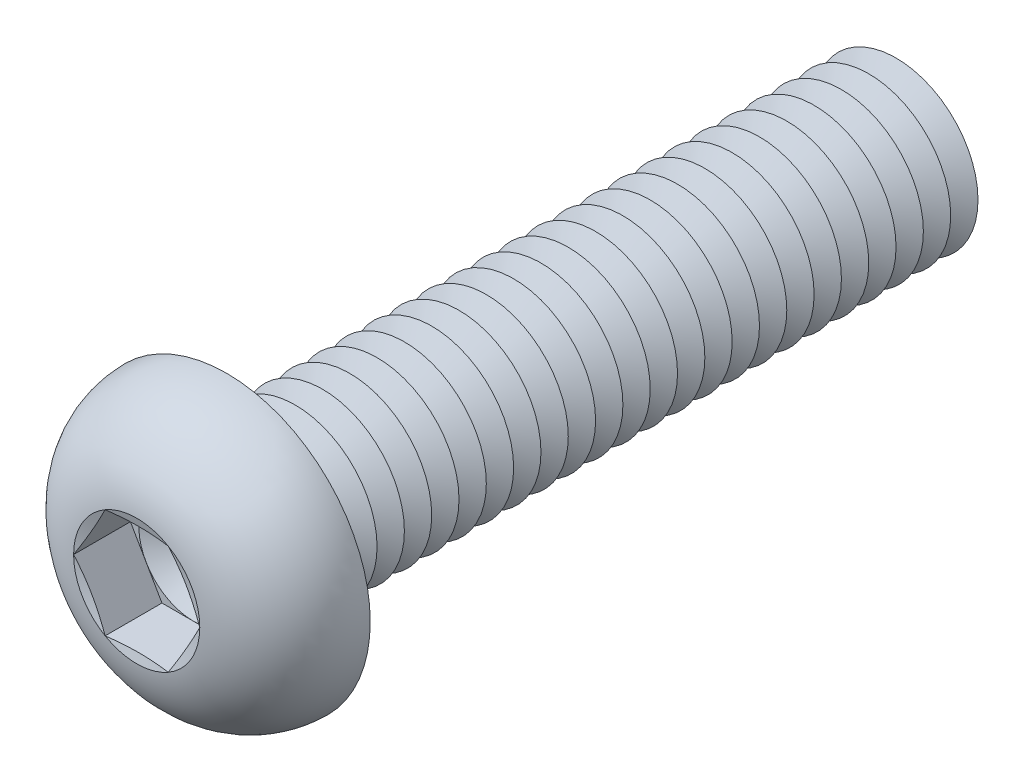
from build123d import *

# Parameters (mm, degrees)
FILLET1_R          = 0.5
LPATTERN1_COUNT    = 25
LPATTERN1_PITCH    = 1
CUT_EXTRUDE1_DEPTH = 2.08


with BuildPart() as part:
    # Sketch1 → Revolve1 (revolve)
    with BuildSketch(Plane(origin=(0, 0, 0), x_dir=(0, 0, -1), z_dir=(1, 0, 0)), mode=Mode.PRIVATE) as revolve1_sk:
        with BuildLine():
            Line((0, 3), (0, 5.25))
            ThreePointArc((0, 5.25), (-2.210041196, 4.408189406), (-3.3, 2.3094))
            Line((-3.3, 2.3094), (-2.990599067, 1.1547))
            Line((-2.990599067, 1.1547), (-3.3, 1.1547))
            Line((-3.3, 1.1547), (-3.3, 0))
            Line((-3.3, 0), (25, 0))
            Line((25, 0), (25, 3))
            Line((25, 3), (0, 3))
        make_face()
    revolve(revolve1_sk.sketch.rotate(Axis((0, 0, -25), (0, 0, 1)), 90), axis=Axis((0, 0, -25), (0, 0, 1)))

    # Fillet1
    fillet1_edges = [part.edges().sort_by_distance(p)[0] for p in [
        (3, 0, 0),
    ]]
    fillet(fillet1_edges, radius=FILLET1_R)

    # Sketch2 → Cut-Revolve1 (revolve, cut)
    with BuildSketch(Plane(origin=(0, 0, 0), x_dir=(0, 0, -1), z_dir=(1, 0, 0)), mode=Mode.PRIVATE) as cut_revolve1_sk:
        Polygon((24.5, 3), (25.5, 3), (25, 2.133974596), align=None)
    cut_revolve1 = revolve(cut_revolve1_sk.sketch.rotate(Axis((0, 0, -25), (0, 0, -1)), 270), axis=Axis((0, 0, -25), (0, 0, -1)), mode=Mode.SUBTRACT)

    # LPattern1: Cut-Revolve1 ×25
    with Locations(*[(0, 0, i * LPATTERN1_PITCH) for i in range(1, LPATTERN1_COUNT)]):
        add(cut_revolve1, mode=Mode.SUBTRACT)

    # Sketch3 → Cut-Extrude1 (cut)
    with BuildSketch(Plane.XY.offset(3.3)):
        Polygon((1.1547, 1.999999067), (-1.1547, 1.999999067), (-2.3094, 0), (-1.1547, -1.999999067), (1.1547, -1.999999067), (2.3094, 0), align=None)
    extrude(amount=-CUT_EXTRUDE1_DEPTH, mode=Mode.SUBTRACT)

    # Cut-Extrude2 cone 1 section (on through the dimple's axis) → Cut-Extrude2 (revolve, cut)
    with BuildSketch(Plane(origin=(0, 0, 1.22), x_dir=(0, -1, 0), z_dir=(1, 0, 0))):
        Polygon((0, 0), (1.999999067, 0), (0, 1.1547), align=None)
    revolve(axis=Axis((0, 0, 1.22), (0, 0, -1)), mode=Mode.SUBTRACT)


solid = part.part
